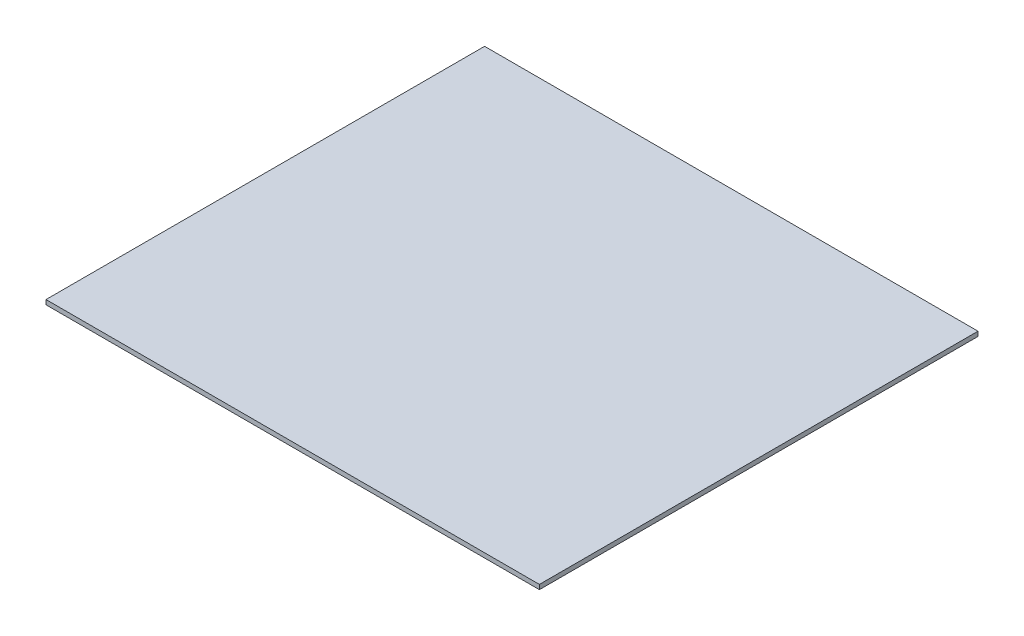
ISO-10303-21;
HEADER;
FILE_DESCRIPTION(('STEP AP214'),'2;1');
FILE_NAME('part.step','',(''),(''),'','','');
FILE_SCHEMA(('AUTOMOTIVE_DESIGN { 1 0 10303 214 1 1 1 1 }'));
ENDSEC;
DATA;
#1=APPLICATION_CONTEXT('core data for automotive mechanical design processes');
#2=APPLICATION_PROTOCOL_DEFINITION('international standard','automotive_design',2000,#1);
#3=PRODUCT_CONTEXT('',#1,'mechanical');
#4=PRODUCT('Part','Part','',(#3));
#5=PRODUCT_RELATED_PRODUCT_CATEGORY('part','',(#4));
#6=PRODUCT_DEFINITION_FORMATION('','',#4);
#7=PRODUCT_DEFINITION_CONTEXT('part definition',#1,'design');
#8=PRODUCT_DEFINITION('design','',#6,#7);
#9=PRODUCT_DEFINITION_SHAPE('','',#8);
#10=(LENGTH_UNIT() NAMED_UNIT(*) SI_UNIT(.MILLI.,.METRE.));
#11=(NAMED_UNIT(*) PLANE_ANGLE_UNIT() SI_UNIT($,.RADIAN.));
#12=(NAMED_UNIT(*) SI_UNIT($,.STERADIAN.) SOLID_ANGLE_UNIT());
#13=UNCERTAINTY_MEASURE_WITH_UNIT(LENGTH_MEASURE(1.E-05),#10,'distance_accuracy_value','');
#14=(GEOMETRIC_REPRESENTATION_CONTEXT(3) GLOBAL_UNCERTAINTY_ASSIGNED_CONTEXT((#13)) GLOBAL_UNIT_ASSIGNED_CONTEXT((#10,
#11,#12)) REPRESENTATION_CONTEXT('',''));
#15=CARTESIAN_POINT('',(0.,0.,0.));
#16=DIRECTION('',(0.,0.,1.));
#17=DIRECTION('',(1.,0.,0.));
#18=AXIS2_PLACEMENT_3D('',#15,#16,#17);
#19=CARTESIAN_POINT('',(0.,-12.7,0.));
#20=DIRECTION('',(-1.,0.,0.));
#21=DIRECTION('',(0.,0.,1.));
#22=AXIS2_PLACEMENT_3D('',#19,#20,#21);
#23=PLANE('',#22);
#24=DIRECTION('',(0.,0.,1.));
#25=VECTOR('',#24,1.);
#26=CARTESIAN_POINT('',(0.,0.,0.));
#27=LINE('',#26,#25);
#28=CARTESIAN_POINT('',(0.,0.,-1219.2));
#29=VERTEX_POINT('',#28);
#30=CARTESIAN_POINT('',(0.,0.,0.));
#31=VERTEX_POINT('',#30);
#32=EDGE_CURVE('E95',#29,#31,#27,.T.);
#33=ORIENTED_EDGE('',*,*,#32,.F.);
#34=DIRECTION('',(0.,1.,0.));
#35=VECTOR('',#34,1.);
#36=CARTESIAN_POINT('',(0.,-12.7,-1219.2));
#37=LINE('',#36,#35);
#38=CARTESIAN_POINT('',(0.,-12.7,-1219.2));
#39=VERTEX_POINT('',#38);
#40=EDGE_CURVE('E11',#39,#29,#37,.T.);
#41=ORIENTED_EDGE('',*,*,#40,.F.);
#42=DIRECTION('',(0.,0.,1.));
#43=VECTOR('',#42,1.);
#44=CARTESIAN_POINT('',(0.,-12.7,0.));
#45=LINE('',#44,#43);
#46=CARTESIAN_POINT('',(0.,-12.7,0.));
#47=VERTEX_POINT('',#46);
#48=EDGE_CURVE('E89',#39,#47,#45,.T.);
#49=ORIENTED_EDGE('',*,*,#48,.T.);
#50=DIRECTION('',(0.,1.,0.));
#51=VECTOR('',#50,1.);
#52=CARTESIAN_POINT('',(0.,-12.7,0.));
#53=LINE('',#52,#51);
#54=EDGE_CURVE('E34',#47,#31,#53,.T.);
#55=ORIENTED_EDGE('',*,*,#54,.T.);
#56=EDGE_LOOP('',(#33,#41,#49,#55));
#57=FACE_BOUND('',#56,.T.);
#58=ADVANCED_FACE('F31',(#57),#23,.T.);
#59=CARTESIAN_POINT('',(0.,-12.7,-1219.2));
#60=DIRECTION('',(0.,0.,-1.));
#61=DIRECTION('',(-1.,0.,0.));
#62=AXIS2_PLACEMENT_3D('',#59,#60,#61);
#63=PLANE('',#62);
#64=DIRECTION('',(-1.,0.,0.));
#65=VECTOR('',#64,1.);
#66=CARTESIAN_POINT('',(0.,0.,-1219.2));
#67=LINE('',#66,#65);
#68=CARTESIAN_POINT('',(1371.6,0.,-1219.2));
#69=VERTEX_POINT('',#68);
#70=EDGE_CURVE('E91',#69,#29,#67,.T.);
#71=ORIENTED_EDGE('',*,*,#70,.F.);
#72=DIRECTION('',(0.,1.,0.));
#73=VECTOR('',#72,1.);
#74=CARTESIAN_POINT('',(1371.6,-12.7,-1219.2));
#75=LINE('',#74,#73);
#76=CARTESIAN_POINT('',(1371.6,-12.7,-1219.2));
#77=VERTEX_POINT('',#76);
#78=EDGE_CURVE('E40',#77,#69,#75,.T.);
#79=ORIENTED_EDGE('',*,*,#78,.F.);
#80=DIRECTION('',(-1.,0.,0.));
#81=VECTOR('',#80,1.);
#82=CARTESIAN_POINT('',(0.,-12.7,-1219.2));
#83=LINE('',#82,#81);
#84=EDGE_CURVE('E86',#77,#39,#83,.T.);
#85=ORIENTED_EDGE('',*,*,#84,.T.);
#86=ORIENTED_EDGE('',*,*,#40,.T.);
#87=EDGE_LOOP('',(#71,#79,#85,#86));
#88=FACE_BOUND('',#87,.T.);
#89=ADVANCED_FACE('F105',(#88),#63,.T.);
#90=CARTESIAN_POINT('',(1371.6,-12.7,0.));
#91=DIRECTION('',(1.,0.,0.));
#92=DIRECTION('',(0.,0.,-1.));
#93=AXIS2_PLACEMENT_3D('',#90,#91,#92);
#94=PLANE('',#93);
#95=DIRECTION('',(0.,0.,-1.));
#96=VECTOR('',#95,1.);
#97=CARTESIAN_POINT('',(1371.6,0.,0.));
#98=LINE('',#97,#96);
#99=CARTESIAN_POINT('',(1371.6,0.,0.));
#100=VERTEX_POINT('',#99);
#101=EDGE_CURVE('E81',#100,#69,#98,.T.);
#102=ORIENTED_EDGE('',*,*,#101,.F.);
#103=DIRECTION('',(0.,1.,0.));
#104=VECTOR('',#103,1.);
#105=CARTESIAN_POINT('',(1371.6,-12.7,0.));
#106=LINE('',#105,#104);
#107=CARTESIAN_POINT('',(1371.6,-12.7,0.));
#108=VERTEX_POINT('',#107);
#109=EDGE_CURVE('E76',#108,#100,#106,.T.);
#110=ORIENTED_EDGE('',*,*,#109,.F.);
#111=DIRECTION('',(0.,0.,-1.));
#112=VECTOR('',#111,1.);
#113=CARTESIAN_POINT('',(1371.6,-12.7,0.));
#114=LINE('',#113,#112);
#115=EDGE_CURVE('E79',#108,#77,#114,.T.);
#116=ORIENTED_EDGE('',*,*,#115,.T.);
#117=ORIENTED_EDGE('',*,*,#78,.T.);
#118=EDGE_LOOP('',(#102,#110,#116,#117));
#119=FACE_BOUND('',#118,.T.);
#120=ADVANCED_FACE('F78',(#119),#94,.T.);
#121=CARTESIAN_POINT('',(0.,-12.7,0.));
#122=DIRECTION('',(0.,0.,1.));
#123=DIRECTION('',(1.,0.,0.));
#124=AXIS2_PLACEMENT_3D('',#121,#122,#123);
#125=PLANE('',#124);
#126=DIRECTION('',(1.,0.,0.));
#127=VECTOR('',#126,1.);
#128=CARTESIAN_POINT('',(0.,0.,0.));
#129=LINE('',#128,#127);
#130=EDGE_CURVE('E98',#31,#100,#129,.T.);
#131=ORIENTED_EDGE('',*,*,#130,.F.);
#132=ORIENTED_EDGE('',*,*,#54,.F.);
#133=DIRECTION('',(1.,0.,0.));
#134=VECTOR('',#133,1.);
#135=CARTESIAN_POINT('',(0.,-12.7,0.));
#136=LINE('',#135,#134);
#137=EDGE_CURVE('E85',#47,#108,#136,.T.);
#138=ORIENTED_EDGE('',*,*,#137,.T.);
#139=ORIENTED_EDGE('',*,*,#109,.T.);
#140=EDGE_LOOP('',(#131,#132,#138,#139));
#141=FACE_BOUND('',#140,.T.);
#142=ADVANCED_FACE('F88',(#141),#125,.T.);
#143=CARTESIAN_POINT('',(0.,-12.7,-1219.2));
#144=DIRECTION('',(0.,-1.,0.));
#145=DIRECTION('',(0.,0.,-1.));
#146=AXIS2_PLACEMENT_3D('',#143,#144,#145);
#147=PLANE('',#146);
#148=ORIENTED_EDGE('',*,*,#48,.F.);
#149=ORIENTED_EDGE('',*,*,#84,.F.);
#150=ORIENTED_EDGE('',*,*,#115,.F.);
#151=ORIENTED_EDGE('',*,*,#137,.F.);
#152=EDGE_LOOP('',(#148,#149,#150,#151));
#153=FACE_BOUND('',#152,.T.);
#154=ADVANCED_FACE('F84',(#153),#147,.T.);
#155=CARTESIAN_POINT('',(0.,0.,-1219.2));
#156=DIRECTION('',(0.,-1.,0.));
#157=DIRECTION('',(0.,0.,-1.));
#158=AXIS2_PLACEMENT_3D('',#155,#156,#157);
#159=PLANE('',#158);
#160=ORIENTED_EDGE('',*,*,#32,.T.);
#161=ORIENTED_EDGE('',*,*,#130,.T.);
#162=ORIENTED_EDGE('',*,*,#101,.T.);
#163=ORIENTED_EDGE('',*,*,#70,.T.);
#164=EDGE_LOOP('',(#160,#161,#162,#163));
#165=FACE_BOUND('',#164,.T.);
#166=ADVANCED_FACE('F104',(#165),#159,.F.);
#167=CLOSED_SHELL('',(#58,#89,#120,#142,#154,#166));
#168=MANIFOLD_SOLID_BREP('B2',#167);
#169=ADVANCED_BREP_SHAPE_REPRESENTATION('',(#18,#168),#14);
#170=SHAPE_DEFINITION_REPRESENTATION(#9,#169);
ENDSEC;
END-ISO-10303-21;
